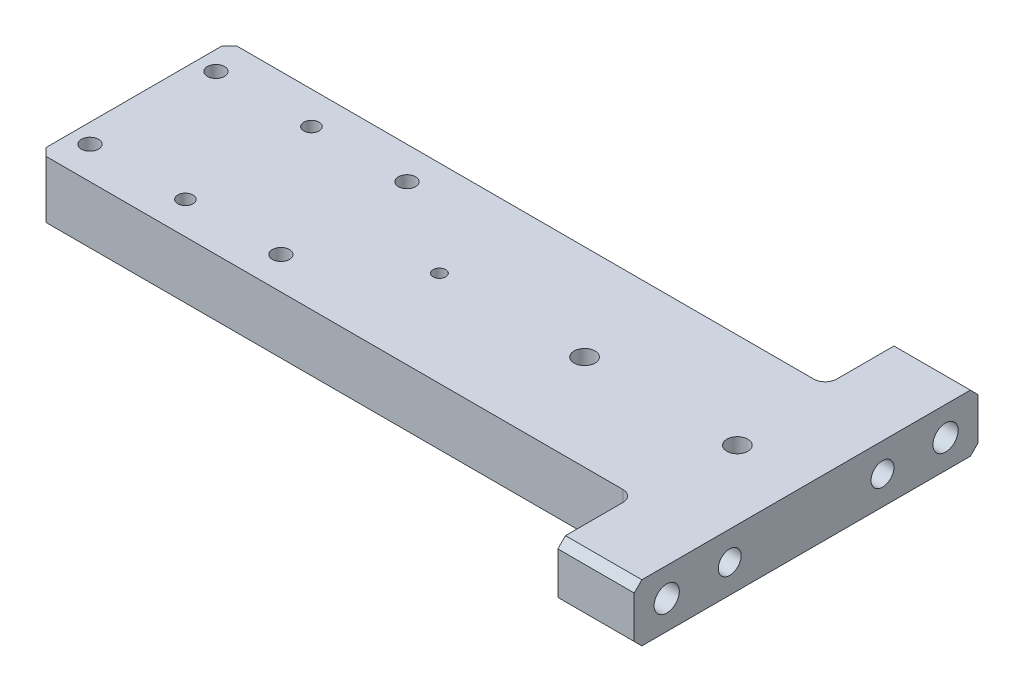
ISO-10303-21;
HEADER;
FILE_DESCRIPTION(('STEP AP214'),'2;1');
FILE_NAME('part.step','',(''),(''),'','','');
FILE_SCHEMA(('AUTOMOTIVE_DESIGN { 1 0 10303 214 1 1 1 1 }'));
ENDSEC;
DATA;
#1=APPLICATION_CONTEXT('core data for automotive mechanical design processes');
#2=APPLICATION_PROTOCOL_DEFINITION('international standard','automotive_design',2000,#1);
#3=PRODUCT_CONTEXT('',#1,'mechanical');
#4=PRODUCT('Part','Part','',(#3));
#5=PRODUCT_RELATED_PRODUCT_CATEGORY('part','',(#4));
#6=PRODUCT_DEFINITION_FORMATION('','',#4);
#7=PRODUCT_DEFINITION_CONTEXT('part definition',#1,'design');
#8=PRODUCT_DEFINITION('design','',#6,#7);
#9=PRODUCT_DEFINITION_SHAPE('','',#8);
#10=(LENGTH_UNIT() NAMED_UNIT(*) SI_UNIT(.MILLI.,.METRE.));
#11=(NAMED_UNIT(*) PLANE_ANGLE_UNIT() SI_UNIT($,.RADIAN.));
#12=(NAMED_UNIT(*) SI_UNIT($,.STERADIAN.) SOLID_ANGLE_UNIT());
#13=UNCERTAINTY_MEASURE_WITH_UNIT(LENGTH_MEASURE(1.E-05),#10,'distance_accuracy_value','');
#14=(GEOMETRIC_REPRESENTATION_CONTEXT(3) GLOBAL_UNCERTAINTY_ASSIGNED_CONTEXT((#13)) GLOBAL_UNIT_ASSIGNED_CONTEXT((#10,
#11,#12)) REPRESENTATION_CONTEXT('',''));
#15=CARTESIAN_POINT('',(0.,0.,0.));
#16=DIRECTION('',(0.,0.,1.));
#17=DIRECTION('',(1.,0.,0.));
#18=AXIS2_PLACEMENT_3D('',#15,#16,#17);
#19=CARTESIAN_POINT('',(88.,15.,-45.));
#20=DIRECTION('',(-1.,0.,0.));
#21=DIRECTION('',(0.,0.,1.));
#22=AXIS2_PLACEMENT_3D('',#19,#20,#21);
#23=PLANE('',#22);
#24=CARTESIAN_POINT('',(88.,7.5,20.));
#25=DIRECTION('',(1.,0.,0.));
#26=DIRECTION('',(0.,0.,-1.));
#27=AXIS2_PLACEMENT_3D('',#24,#25,#26);
#28=CIRCLE('',#27,3.);
#29=CARTESIAN_POINT('',(88.,7.5,17.));
#30=VERTEX_POINT('',#29);
#31=EDGE_CURVE('E191',#30,#30,#28,.T.);
#32=ORIENTED_EDGE('',*,*,#31,.F.);
#33=EDGE_LOOP('',(#32));
#34=FACE_BOUND('',#33,.T.);
#35=CARTESIAN_POINT('',(88.,7.5,-20.));
#36=DIRECTION('',(1.,0.,0.));
#37=DIRECTION('',(0.,0.,-1.));
#38=AXIS2_PLACEMENT_3D('',#35,#36,#37);
#39=CIRCLE('',#38,3.);
#40=CARTESIAN_POINT('',(88.,7.5,-23.));
#41=VERTEX_POINT('',#40);
#42=EDGE_CURVE('E197',#41,#41,#39,.T.);
#43=ORIENTED_EDGE('',*,*,#42,.F.);
#44=EDGE_LOOP('',(#43));
#45=FACE_BOUND('',#44,.T.);
#46=CARTESIAN_POINT('',(88.0000000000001,7.5,36.5));
#47=DIRECTION('',(-1.,0.,0.));
#48=DIRECTION('',(0.,0.,1.));
#49=AXIS2_PLACEMENT_3D('',#46,#47,#48);
#50=CIRCLE('',#49,3.3);
#51=CARTESIAN_POINT('',(88.0000000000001,7.5,39.8));
#52=VERTEX_POINT('',#51);
#53=EDGE_CURVE('E206',#52,#52,#50,.T.);
#54=ORIENTED_EDGE('',*,*,#53,.T.);
#55=EDGE_LOOP('',(#54));
#56=FACE_BOUND('',#55,.T.);
#57=CARTESIAN_POINT('',(88.,7.5,-36.5));
#58=DIRECTION('',(-1.,0.,0.));
#59=DIRECTION('',(0.,0.,1.));
#60=AXIS2_PLACEMENT_3D('',#57,#58,#59);
#61=CIRCLE('',#60,3.3);
#62=CARTESIAN_POINT('',(88.,7.5,-33.2000000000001));
#63=VERTEX_POINT('',#62);
#64=EDGE_CURVE('E212',#63,#63,#61,.T.);
#65=ORIENTED_EDGE('',*,*,#64,.T.);
#66=EDGE_LOOP('',(#65));
#67=FACE_BOUND('',#66,.T.);
#68=DIRECTION('',(0.,0.,-1.));
#69=VECTOR('',#68,1.);
#70=CARTESIAN_POINT('',(88.,0.,-45.));
#71=LINE('',#70,#69);
#72=CARTESIAN_POINT('',(88.,0.,43.));
#73=VERTEX_POINT('',#72);
#74=CARTESIAN_POINT('',(88.,0.,-43.));
#75=VERTEX_POINT('',#74);
#76=EDGE_CURVE('E302',#73,#75,#71,.T.);
#77=ORIENTED_EDGE('',*,*,#76,.T.);
#78=DIRECTION('',(0.,-0.707106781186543,0.707106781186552));
#79=VECTOR('',#78,1.);
#80=CARTESIAN_POINT('',(88.,2.,-45.));
#81=LINE('',#80,#79);
#82=CARTESIAN_POINT('',(88.,1.99999999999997,-45.));
#83=VERTEX_POINT('',#82);
#84=EDGE_CURVE('E389',#75,#83,#81,.F.);
#85=ORIENTED_EDGE('',*,*,#84,.T.);
#86=DIRECTION('',(0.,-1.,0.));
#87=VECTOR('',#86,1.);
#88=CARTESIAN_POINT('',(88.,15.,-45.));
#89=LINE('',#88,#87);
#90=CARTESIAN_POINT('',(88.,13.,-45.));
#91=VERTEX_POINT('',#90);
#92=EDGE_CURVE('E317',#91,#83,#89,.T.);
#93=ORIENTED_EDGE('',*,*,#92,.F.);
#94=DIRECTION('',(0.,0.707106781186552,0.707106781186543));
#95=VECTOR('',#94,1.);
#96=CARTESIAN_POINT('',(88.,15.,-43.));
#97=LINE('',#96,#95);
#98=CARTESIAN_POINT('',(88.,15.,-43.));
#99=VERTEX_POINT('',#98);
#100=EDGE_CURVE('E383',#91,#99,#97,.T.);
#101=ORIENTED_EDGE('',*,*,#100,.T.);
#102=DIRECTION('',(0.,0.,-1.));
#103=VECTOR('',#102,1.);
#104=CARTESIAN_POINT('',(88.,15.,-45.));
#105=LINE('',#104,#103);
#106=CARTESIAN_POINT('',(88.,15.,43.));
#107=VERTEX_POINT('',#106);
#108=EDGE_CURVE('E303',#107,#99,#105,.T.);
#109=ORIENTED_EDGE('',*,*,#108,.F.);
#110=DIRECTION('',(0.,-0.707106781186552,0.707106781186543));
#111=VECTOR('',#110,1.);
#112=CARTESIAN_POINT('',(88.,15.,43.));
#113=LINE('',#112,#111);
#114=CARTESIAN_POINT('',(88.,13.,45.));
#115=VERTEX_POINT('',#114);
#116=EDGE_CURVE('E385',#107,#115,#113,.T.);
#117=ORIENTED_EDGE('',*,*,#116,.T.);
#118=DIRECTION('',(0.,-1.,0.));
#119=VECTOR('',#118,1.);
#120=CARTESIAN_POINT('',(88.,15.,45.));
#121=LINE('',#120,#119);
#122=CARTESIAN_POINT('',(88.,1.99999999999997,45.));
#123=VERTEX_POINT('',#122);
#124=EDGE_CURVE('E310',#115,#123,#121,.T.);
#125=ORIENTED_EDGE('',*,*,#124,.T.);
#126=DIRECTION('',(0.,0.707106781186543,0.707106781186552));
#127=VECTOR('',#126,1.);
#128=CARTESIAN_POINT('',(88.,1.99999999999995,45.));
#129=LINE('',#128,#127);
#130=EDGE_CURVE('E387',#123,#73,#129,.F.);
#131=ORIENTED_EDGE('',*,*,#130,.T.);
#132=EDGE_LOOP('',(#77,#85,#93,#101,#109,#117,#125,#131));
#133=FACE_BOUND('',#132,.T.);
#134=ADVANCED_FACE('F41',(#34,#45,#56,#67,#133),#23,.F.);
#135=CARTESIAN_POINT('',(-88.,15.,-45.));
#136=DIRECTION('',(0.,0.,1.));
#137=DIRECTION('',(1.,0.,0.));
#138=AXIS2_PLACEMENT_3D('',#135,#136,#137);
#139=PLANE('',#138);
#140=ORIENTED_EDGE('',*,*,#92,.T.);
#141=DIRECTION('',(-1.,0.,0.));
#142=VECTOR('',#141,1.);
#143=CARTESIAN_POINT('',(-88.,1.99999999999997,-45.));
#144=LINE('',#143,#142);
#145=CARTESIAN_POINT('',(68.,1.99999999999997,-45.));
#146=VERTEX_POINT('',#145);
#147=EDGE_CURVE('E376',#83,#146,#144,.T.);
#148=ORIENTED_EDGE('',*,*,#147,.T.);
#149=DIRECTION('',(0.,1.,0.));
#150=VECTOR('',#149,1.);
#151=CARTESIAN_POINT('',(68.,15.,-45.));
#152=LINE('',#151,#150);
#153=CARTESIAN_POINT('',(68.,13.,-45.));
#154=VERTEX_POINT('',#153);
#155=EDGE_CURVE('E219',#146,#154,#152,.T.);
#156=ORIENTED_EDGE('',*,*,#155,.T.);
#157=DIRECTION('',(1.,0.,0.));
#158=VECTOR('',#157,1.);
#159=CARTESIAN_POINT('',(88.,13.,-45.));
#160=LINE('',#159,#158);
#161=EDGE_CURVE('E374',#154,#91,#160,.T.);
#162=ORIENTED_EDGE('',*,*,#161,.T.);
#163=EDGE_LOOP('',(#140,#148,#156,#162));
#164=FACE_BOUND('',#163,.T.);
#165=ADVANCED_FACE('F424',(#164),#139,.F.);
#166=CARTESIAN_POINT('',(-88.,15.,-45.));
#167=DIRECTION('',(1.,0.,0.));
#168=DIRECTION('',(0.,0.,-1.));
#169=AXIS2_PLACEMENT_3D('',#166,#167,#168);
#170=PLANE('',#169);
#171=DIRECTION('',(0.,0.,1.));
#172=VECTOR('',#171,1.);
#173=CARTESIAN_POINT('',(-88.,0.,-45.));
#174=LINE('',#173,#172);
#175=CARTESIAN_POINT('',(-88.,0.,-23.));
#176=VERTEX_POINT('',#175);
#177=CARTESIAN_POINT('',(-88.,0.,22.9999999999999));
#178=VERTEX_POINT('',#177);
#179=EDGE_CURVE('E307',#176,#178,#174,.T.);
#180=ORIENTED_EDGE('',*,*,#179,.T.);
#181=DIRECTION('',(0.,1.,0.));
#182=VECTOR('',#181,1.);
#183=CARTESIAN_POINT('',(-88.,15.,23.));
#184=LINE('',#183,#182);
#185=CARTESIAN_POINT('',(-88.,15.,22.9999999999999));
#186=VERTEX_POINT('',#185);
#187=EDGE_CURVE('E349',#178,#186,#184,.T.);
#188=ORIENTED_EDGE('',*,*,#187,.T.);
#189=DIRECTION('',(0.,0.,1.));
#190=VECTOR('',#189,1.);
#191=CARTESIAN_POINT('',(-88.,15.,-45.));
#192=LINE('',#191,#190);
#193=CARTESIAN_POINT('',(-88.,15.,-23.));
#194=VERTEX_POINT('',#193);
#195=EDGE_CURVE('E306',#194,#186,#192,.T.);
#196=ORIENTED_EDGE('',*,*,#195,.F.);
#197=DIRECTION('',(0.,-1.,0.));
#198=VECTOR('',#197,1.);
#199=CARTESIAN_POINT('',(-88.,15.,-23.));
#200=LINE('',#199,#198);
#201=EDGE_CURVE('E346',#194,#176,#200,.T.);
#202=ORIENTED_EDGE('',*,*,#201,.T.);
#203=EDGE_LOOP('',(#180,#188,#196,#202));
#204=FACE_BOUND('',#203,.T.);
#205=ADVANCED_FACE('F447',(#204),#170,.F.);
#206=CARTESIAN_POINT('',(-88.,15.,45.));
#207=DIRECTION('',(0.,0.,-1.));
#208=DIRECTION('',(-1.,0.,0.));
#209=AXIS2_PLACEMENT_3D('',#206,#207,#208);
#210=PLANE('',#209);
#211=DIRECTION('',(0.,-1.,0.));
#212=VECTOR('',#211,1.);
#213=CARTESIAN_POINT('',(68.,15.,45.));
#214=LINE('',#213,#212);
#215=CARTESIAN_POINT('',(68.,13.,45.));
#216=VERTEX_POINT('',#215);
#217=CARTESIAN_POINT('',(68.,1.99999999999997,45.));
#218=VERTEX_POINT('',#217);
#219=EDGE_CURVE('E234',#216,#218,#214,.T.);
#220=ORIENTED_EDGE('',*,*,#219,.T.);
#221=DIRECTION('',(1.,0.,0.));
#222=VECTOR('',#221,1.);
#223=CARTESIAN_POINT('',(-88.,1.99999999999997,45.));
#224=LINE('',#223,#222);
#225=EDGE_CURVE('E392',#218,#123,#224,.T.);
#226=ORIENTED_EDGE('',*,*,#225,.T.);
#227=ORIENTED_EDGE('',*,*,#124,.F.);
#228=DIRECTION('',(-1.,0.,0.));
#229=VECTOR('',#228,1.);
#230=CARTESIAN_POINT('',(68.,13.,45.));
#231=LINE('',#230,#229);
#232=EDGE_CURVE('E62',#115,#216,#231,.T.);
#233=ORIENTED_EDGE('',*,*,#232,.T.);
#234=EDGE_LOOP('',(#220,#226,#227,#233));
#235=FACE_BOUND('',#234,.T.);
#236=ADVANCED_FACE('F407',(#235),#210,.F.);
#237=CARTESIAN_POINT('',(0.,15.,0.));
#238=DIRECTION('',(0.,1.,0.));
#239=DIRECTION('',(0.,0.,1.));
#240=AXIS2_PLACEMENT_3D('',#237,#238,#239);
#241=PLANE('',#240);
#242=CARTESIAN_POINT('',(70.,15.,0.));
#243=DIRECTION('',(0.,-1.,0.));
#244=DIRECTION('',(0.,0.,-1.));
#245=AXIS2_PLACEMENT_3D('',#242,#243,#244);
#246=CIRCLE('',#245,2.75);
#247=CARTESIAN_POINT('',(70.,15.,-2.75));
#248=VERTEX_POINT('',#247);
#249=EDGE_CURVE('E648',#248,#248,#246,.T.);
#250=ORIENTED_EDGE('',*,*,#249,.T.);
#251=EDGE_LOOP('',(#250));
#252=FACE_BOUND('',#251,.T.);
#253=CARTESIAN_POINT('',(30.,15.,0.));
#254=DIRECTION('',(0.,-1.,0.));
#255=DIRECTION('',(0.,0.,-1.));
#256=AXIS2_PLACEMENT_3D('',#253,#254,#255);
#257=CIRCLE('',#256,2.75);
#258=CARTESIAN_POINT('',(30.,15.,-2.75));
#259=VERTEX_POINT('',#258);
#260=EDGE_CURVE('E179',#259,#259,#257,.T.);
#261=ORIENTED_EDGE('',*,*,#260,.T.);
#262=EDGE_LOOP('',(#261));
#263=FACE_BOUND('',#262,.T.);
#264=ORIENTED_EDGE('',*,*,#195,.T.);
#265=DIRECTION('',(-0.707106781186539,0.,-0.707106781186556));
#266=VECTOR('',#265,1.);
#267=CARTESIAN_POINT('',(-55.500000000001,15.,55.4999999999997));
#268=LINE('',#267,#266);
#269=CARTESIAN_POINT('',(-86.,15.,25.));
#270=VERTEX_POINT('',#269);
#271=EDGE_CURVE('E360',#186,#270,#268,.F.);
#272=ORIENTED_EDGE('',*,*,#271,.T.);
#273=DIRECTION('',(-1.,0.,0.));
#274=VECTOR('',#273,1.);
#275=CARTESIAN_POINT('',(-144.979037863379,15.,25.));
#276=LINE('',#275,#274);
#277=CARTESIAN_POINT('',(65.,15.,25.));
#278=VERTEX_POINT('',#277);
#279=EDGE_CURVE('E220',#278,#270,#276,.T.);
#280=ORIENTED_EDGE('',*,*,#279,.F.);
#281=CARTESIAN_POINT('',(65.0000000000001,15.,28.));
#282=DIRECTION('',(0.,1.,0.));
#283=DIRECTION('',(0.,0.,1.));
#284=AXIS2_PLACEMENT_3D('',#281,#282,#283);
#285=CIRCLE('',#284,3.);
#286=CARTESIAN_POINT('',(68.,15.,28.));
#287=VERTEX_POINT('',#286);
#288=EDGE_CURVE('E341',#278,#287,#285,.F.);
#289=ORIENTED_EDGE('',*,*,#288,.T.);
#290=DIRECTION('',(0.,0.,-1.));
#291=VECTOR('',#290,1.);
#292=CARTESIAN_POINT('',(68.0000000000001,15.,65.6184121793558));
#293=LINE('',#292,#291);
#294=CARTESIAN_POINT('',(68.,15.,43.));
#295=VERTEX_POINT('',#294);
#296=EDGE_CURVE('E221',#295,#287,#293,.T.);
#297=ORIENTED_EDGE('',*,*,#296,.F.);
#298=DIRECTION('',(1.,0.,0.));
#299=VECTOR('',#298,1.);
#300=CARTESIAN_POINT('',(88.,15.,43.));
#301=LINE('',#300,#299);
#302=EDGE_CURVE('E355',#295,#107,#301,.T.);
#303=ORIENTED_EDGE('',*,*,#302,.T.);
#304=ORIENTED_EDGE('',*,*,#108,.T.);
#305=DIRECTION('',(-1.,0.,0.));
#306=VECTOR('',#305,1.);
#307=CARTESIAN_POINT('',(68.,15.,-43.));
#308=LINE('',#307,#306);
#309=CARTESIAN_POINT('',(68.,15.,-43.));
#310=VERTEX_POINT('',#309);
#311=EDGE_CURVE('E352',#99,#310,#308,.T.);
#312=ORIENTED_EDGE('',*,*,#311,.T.);
#313=DIRECTION('',(0.,0.,-1.));
#314=VECTOR('',#313,1.);
#315=CARTESIAN_POINT('',(68.,15.,-88.7614918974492));
#316=LINE('',#315,#314);
#317=CARTESIAN_POINT('',(68.,15.,-28.));
#318=VERTEX_POINT('',#317);
#319=EDGE_CURVE('E228',#318,#310,#316,.T.);
#320=ORIENTED_EDGE('',*,*,#319,.F.);
#321=CARTESIAN_POINT('',(65.,15.,-28.));
#322=DIRECTION('',(0.,1.,0.));
#323=DIRECTION('',(0.,0.,1.));
#324=AXIS2_PLACEMENT_3D('',#321,#322,#323);
#325=CIRCLE('',#324,3.);
#326=CARTESIAN_POINT('',(65.,15.,-25.));
#327=VERTEX_POINT('',#326);
#328=EDGE_CURVE('E336',#318,#327,#325,.F.);
#329=ORIENTED_EDGE('',*,*,#328,.T.);
#330=DIRECTION('',(1.,0.,0.));
#331=VECTOR('',#330,1.);
#332=CARTESIAN_POINT('',(-144.979037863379,15.,-25.));
#333=LINE('',#332,#331);
#334=CARTESIAN_POINT('',(-86.,15.,-25.));
#335=VERTEX_POINT('',#334);
#336=EDGE_CURVE('E215',#335,#327,#333,.T.);
#337=ORIENTED_EDGE('',*,*,#336,.F.);
#338=DIRECTION('',(0.707106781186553,0.,-0.707106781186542));
#339=VECTOR('',#338,1.);
#340=CARTESIAN_POINT('',(-55.4999999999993,15.,-55.5000000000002));
#341=LINE('',#340,#339);
#342=EDGE_CURVE('E358',#335,#194,#341,.F.);
#343=ORIENTED_EDGE('',*,*,#342,.T.);
#344=EDGE_LOOP('',(#264,#272,#280,#289,#297,#303,#304,#312,#320,#329,#337,#343));
#345=FACE_BOUND('',#344,.T.);
#346=CARTESIAN_POINT('',(-7.99999999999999,15.,0.));
#347=DIRECTION('',(0.,1.,0.));
#348=DIRECTION('',(0.,0.,1.));
#349=AXIS2_PLACEMENT_3D('',#346,#347,#348);
#350=CIRCLE('',#349,1.65);
#351=CARTESIAN_POINT('',(-7.99999999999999,15.,1.65));
#352=VERTEX_POINT('',#351);
#353=EDGE_CURVE('E236',#352,#352,#350,.T.);
#354=ORIENTED_EDGE('',*,*,#353,.F.);
#355=EDGE_LOOP('',(#354));
#356=FACE_BOUND('',#355,.T.);
#357=CARTESIAN_POINT('',(-58.,15.,16.5));
#358=DIRECTION('',(0.,1.,0.));
#359=DIRECTION('',(0.,0.,1.));
#360=AXIS2_PLACEMENT_3D('',#357,#358,#359);
#361=CIRCLE('',#360,1.99999999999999);
#362=CARTESIAN_POINT('',(-58.,15.,18.5));
#363=VERTEX_POINT('',#362);
#364=EDGE_CURVE('E242',#363,#363,#361,.T.);
#365=ORIENTED_EDGE('',*,*,#364,.F.);
#366=EDGE_LOOP('',(#365));
#367=FACE_BOUND('',#366,.T.);
#368=CARTESIAN_POINT('',(-58.,15.,-16.5));
#369=DIRECTION('',(0.,1.,0.));
#370=DIRECTION('',(0.,0.,1.));
#371=AXIS2_PLACEMENT_3D('',#368,#369,#370);
#372=CIRCLE('',#371,1.99999999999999);
#373=CARTESIAN_POINT('',(-58.,15.,-14.5));
#374=VERTEX_POINT('',#373);
#375=EDGE_CURVE('E248',#374,#374,#372,.T.);
#376=ORIENTED_EDGE('',*,*,#375,.F.);
#377=EDGE_LOOP('',(#376));
#378=FACE_BOUND('',#377,.T.);
#379=CARTESIAN_POINT('',(-83.,15.,-16.5));
#380=DIRECTION('',(0.,-1.,0.));
#381=DIRECTION('',(0.,0.,-1.));
#382=AXIS2_PLACEMENT_3D('',#379,#380,#381);
#383=CIRCLE('',#382,2.25);
#384=CARTESIAN_POINT('',(-83.,15.,-18.75));
#385=VERTEX_POINT('',#384);
#386=EDGE_CURVE('E263',#385,#385,#383,.T.);
#387=ORIENTED_EDGE('',*,*,#386,.T.);
#388=EDGE_LOOP('',(#387));
#389=FACE_BOUND('',#388,.T.);
#390=CARTESIAN_POINT('',(-83.,15.,16.5));
#391=DIRECTION('',(0.,-1.,0.));
#392=DIRECTION('',(0.,0.,-1.));
#393=AXIS2_PLACEMENT_3D('',#390,#391,#392);
#394=CIRCLE('',#393,2.25);
#395=CARTESIAN_POINT('',(-83.,15.,14.25));
#396=VERTEX_POINT('',#395);
#397=EDGE_CURVE('E275',#396,#396,#394,.T.);
#398=ORIENTED_EDGE('',*,*,#397,.T.);
#399=EDGE_LOOP('',(#398));
#400=FACE_BOUND('',#399,.T.);
#401=CARTESIAN_POINT('',(-33.,15.,-16.5));
#402=DIRECTION('',(0.,-1.,0.));
#403=DIRECTION('',(0.,0.,-1.));
#404=AXIS2_PLACEMENT_3D('',#401,#402,#403);
#405=CIRCLE('',#404,2.25);
#406=CARTESIAN_POINT('',(-33.,15.,-18.75));
#407=VERTEX_POINT('',#406);
#408=EDGE_CURVE('E287',#407,#407,#405,.T.);
#409=ORIENTED_EDGE('',*,*,#408,.T.);
#410=EDGE_LOOP('',(#409));
#411=FACE_BOUND('',#410,.T.);
#412=CARTESIAN_POINT('',(-33.,15.,16.5));
#413=DIRECTION('',(0.,-1.,0.));
#414=DIRECTION('',(0.,0.,-1.));
#415=AXIS2_PLACEMENT_3D('',#412,#413,#414);
#416=CIRCLE('',#415,2.25);
#417=CARTESIAN_POINT('',(-33.,15.,14.25));
#418=VERTEX_POINT('',#417);
#419=EDGE_CURVE('E299',#418,#418,#416,.T.);
#420=ORIENTED_EDGE('',*,*,#419,.T.);
#421=EDGE_LOOP('',(#420));
#422=FACE_BOUND('',#421,.T.);
#423=ADVANCED_FACE('F400',(#252,#263,#345,#356,#367,#378,#389,#400,#411,#422),#241,.T.);
#424=CARTESIAN_POINT('',(0.,0.,0.));
#425=DIRECTION('',(0.,1.,0.));
#426=DIRECTION('',(0.,0.,1.));
#427=AXIS2_PLACEMENT_3D('',#424,#425,#426);
#428=PLANE('',#427);
#429=CARTESIAN_POINT('',(70.,0.,0.));
#430=DIRECTION('',(0.,-1.,0.));
#431=DIRECTION('',(0.,0.,-1.));
#432=AXIS2_PLACEMENT_3D('',#429,#430,#431);
#433=CIRCLE('',#432,4.99999999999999);
#434=CARTESIAN_POINT('',(70.,0.,-4.99999999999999));
#435=VERTEX_POINT('',#434);
#436=EDGE_CURVE('E641',#435,#435,#433,.T.);
#437=ORIENTED_EDGE('',*,*,#436,.F.);
#438=EDGE_LOOP('',(#437));
#439=FACE_BOUND('',#438,.T.);
#440=CARTESIAN_POINT('',(30.,0.,0.));
#441=DIRECTION('',(0.,-1.,0.));
#442=DIRECTION('',(0.,0.,-1.));
#443=AXIS2_PLACEMENT_3D('',#440,#441,#442);
#444=CIRCLE('',#443,5.);
#445=CARTESIAN_POINT('',(30.,0.,-5.));
#446=VERTEX_POINT('',#445);
#447=EDGE_CURVE('E651',#446,#446,#444,.T.);
#448=ORIENTED_EDGE('',*,*,#447,.F.);
#449=EDGE_LOOP('',(#448));
#450=FACE_BOUND('',#449,.T.);
#451=CARTESIAN_POINT('',(-30.,0.,-6.00000000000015));
#452=DIRECTION('',(0.,-1.,0.));
#453=DIRECTION('',(0.,0.,-1.));
#454=AXIS2_PLACEMENT_3D('',#451,#452,#453);
#455=CIRCLE('',#454,1.64999999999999);
#456=CARTESIAN_POINT('',(-30.,0.,-7.65000000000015));
#457=VERTEX_POINT('',#456);
#458=EDGE_CURVE('E172',#457,#457,#455,.T.);
#459=ORIENTED_EDGE('',*,*,#458,.F.);
#460=EDGE_LOOP('',(#459));
#461=FACE_BOUND('',#460,.T.);
#462=CARTESIAN_POINT('',(-45.,0.,-6.00000000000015));
#463=DIRECTION('',(0.,-1.,0.));
#464=DIRECTION('',(0.,0.,-1.));
#465=AXIS2_PLACEMENT_3D('',#462,#463,#464);
#466=CIRCLE('',#465,1.64999999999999);
#467=CARTESIAN_POINT('',(-45.,0.,-7.65000000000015));
#468=VERTEX_POINT('',#467);
#469=EDGE_CURVE('E185',#468,#468,#466,.T.);
#470=ORIENTED_EDGE('',*,*,#469,.F.);
#471=EDGE_LOOP('',(#470));
#472=FACE_BOUND('',#471,.T.);
#473=CARTESIAN_POINT('',(-7.99999999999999,0.,0.));
#474=DIRECTION('',(0.,1.,0.));
#475=DIRECTION('',(0.,0.,1.));
#476=AXIS2_PLACEMENT_3D('',#473,#474,#475);
#477=CIRCLE('',#476,1.65);
#478=CARTESIAN_POINT('',(-7.99999999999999,0.,1.65));
#479=VERTEX_POINT('',#478);
#480=EDGE_CURVE('E239',#479,#479,#477,.T.);
#481=ORIENTED_EDGE('',*,*,#480,.T.);
#482=EDGE_LOOP('',(#481));
#483=FACE_BOUND('',#482,.T.);
#484=CARTESIAN_POINT('',(-83.,0.,-16.5));
#485=DIRECTION('',(0.,-1.,0.));
#486=DIRECTION('',(0.,0.,-1.));
#487=AXIS2_PLACEMENT_3D('',#484,#485,#486);
#488=CIRCLE('',#487,4.);
#489=CARTESIAN_POINT('',(-83.,0.,-20.5));
#490=VERTEX_POINT('',#489);
#491=EDGE_CURVE('E254',#490,#490,#488,.T.);
#492=ORIENTED_EDGE('',*,*,#491,.F.);
#493=EDGE_LOOP('',(#492));
#494=FACE_BOUND('',#493,.T.);
#495=CARTESIAN_POINT('',(-83.,0.,16.5));
#496=DIRECTION('',(0.,-1.,0.));
#497=DIRECTION('',(0.,0.,-1.));
#498=AXIS2_PLACEMENT_3D('',#495,#496,#497);
#499=CIRCLE('',#498,4.);
#500=CARTESIAN_POINT('',(-83.,0.,12.5));
#501=VERTEX_POINT('',#500);
#502=EDGE_CURVE('E266',#501,#501,#499,.T.);
#503=ORIENTED_EDGE('',*,*,#502,.F.);
#504=EDGE_LOOP('',(#503));
#505=FACE_BOUND('',#504,.T.);
#506=CARTESIAN_POINT('',(-33.,0.,-16.5));
#507=DIRECTION('',(0.,-1.,0.));
#508=DIRECTION('',(0.,0.,-1.));
#509=AXIS2_PLACEMENT_3D('',#506,#507,#508);
#510=CIRCLE('',#509,4.);
#511=CARTESIAN_POINT('',(-33.,0.,-20.5));
#512=VERTEX_POINT('',#511);
#513=EDGE_CURVE('E278',#512,#512,#510,.T.);
#514=ORIENTED_EDGE('',*,*,#513,.F.);
#515=EDGE_LOOP('',(#514));
#516=FACE_BOUND('',#515,.T.);
#517=CARTESIAN_POINT('',(-33.,0.,16.5));
#518=DIRECTION('',(0.,-1.,0.));
#519=DIRECTION('',(0.,0.,-1.));
#520=AXIS2_PLACEMENT_3D('',#517,#518,#519);
#521=CIRCLE('',#520,4.);
#522=CARTESIAN_POINT('',(-33.,0.,12.5));
#523=VERTEX_POINT('',#522);
#524=EDGE_CURVE('E290',#523,#523,#521,.T.);
#525=ORIENTED_EDGE('',*,*,#524,.F.);
#526=EDGE_LOOP('',(#525));
#527=FACE_BOUND('',#526,.T.);
#528=DIRECTION('',(-1.,0.,0.));
#529=VECTOR('',#528,1.);
#530=CARTESIAN_POINT('',(-144.979037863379,0.,25.));
#531=LINE('',#530,#529);
#532=CARTESIAN_POINT('',(65.,0.,25.));
#533=VERTEX_POINT('',#532);
#534=CARTESIAN_POINT('',(-86.,0.,25.));
#535=VERTEX_POINT('',#534);
#536=EDGE_CURVE('E216',#533,#535,#531,.T.);
#537=ORIENTED_EDGE('',*,*,#536,.T.);
#538=DIRECTION('',(0.707106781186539,0.,0.707106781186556));
#539=VECTOR('',#538,1.);
#540=CARTESIAN_POINT('',(-88.,0.,23.));
#541=LINE('',#540,#539);
#542=EDGE_CURVE('E370',#535,#178,#541,.F.);
#543=ORIENTED_EDGE('',*,*,#542,.T.);
#544=ORIENTED_EDGE('',*,*,#179,.F.);
#545=DIRECTION('',(-0.707106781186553,0.,0.707106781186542));
#546=VECTOR('',#545,1.);
#547=CARTESIAN_POINT('',(-88.,0.,-23.));
#548=LINE('',#547,#546);
#549=CARTESIAN_POINT('',(-86.,0.,-25.));
#550=VERTEX_POINT('',#549);
#551=EDGE_CURVE('E368',#176,#550,#548,.F.);
#552=ORIENTED_EDGE('',*,*,#551,.T.);
#553=DIRECTION('',(1.,0.,0.));
#554=VECTOR('',#553,1.);
#555=CARTESIAN_POINT('',(0.,0.,-25.));
#556=LINE('',#555,#554);
#557=CARTESIAN_POINT('',(65.,0.,-25.));
#558=VERTEX_POINT('',#557);
#559=EDGE_CURVE('E320',#550,#558,#556,.T.);
#560=ORIENTED_EDGE('',*,*,#559,.T.);
#561=CARTESIAN_POINT('',(65.,0.,-28.));
#562=DIRECTION('',(0.,1.,0.));
#563=DIRECTION('',(0.,0.,1.));
#564=AXIS2_PLACEMENT_3D('',#561,#562,#563);
#565=CIRCLE('',#564,3.);
#566=CARTESIAN_POINT('',(68.,0.,-28.));
#567=VERTEX_POINT('',#566);
#568=EDGE_CURVE('E339',#558,#567,#565,.T.);
#569=ORIENTED_EDGE('',*,*,#568,.T.);
#570=DIRECTION('',(0.,0.,-1.));
#571=VECTOR('',#570,1.);
#572=CARTESIAN_POINT('',(68.,0.,-88.7614918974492));
#573=LINE('',#572,#571);
#574=CARTESIAN_POINT('',(68.,0.,-43.));
#575=VERTEX_POINT('',#574);
#576=EDGE_CURVE('E223',#567,#575,#573,.T.);
#577=ORIENTED_EDGE('',*,*,#576,.T.);
#578=DIRECTION('',(1.,0.,0.));
#579=VECTOR('',#578,1.);
#580=CARTESIAN_POINT('',(0.,0.,-43.));
#581=LINE('',#580,#579);
#582=EDGE_CURVE('E366',#575,#75,#581,.T.);
#583=ORIENTED_EDGE('',*,*,#582,.T.);
#584=ORIENTED_EDGE('',*,*,#76,.F.);
#585=DIRECTION('',(-1.,0.,0.));
#586=VECTOR('',#585,1.);
#587=CARTESIAN_POINT('',(0.,0.,43.));
#588=LINE('',#587,#586);
#589=CARTESIAN_POINT('',(68.,0.,43.));
#590=VERTEX_POINT('',#589);
#591=EDGE_CURVE('E364',#73,#590,#588,.T.);
#592=ORIENTED_EDGE('',*,*,#591,.T.);
#593=DIRECTION('',(0.,0.,-1.));
#594=VECTOR('',#593,1.);
#595=CARTESIAN_POINT('',(68.,0.,0.));
#596=LINE('',#595,#594);
#597=CARTESIAN_POINT('',(68.,0.,28.));
#598=VERTEX_POINT('',#597);
#599=EDGE_CURVE('E322',#590,#598,#596,.T.);
#600=ORIENTED_EDGE('',*,*,#599,.T.);
#601=CARTESIAN_POINT('',(65.0000000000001,0.,28.));
#602=DIRECTION('',(0.,1.,0.));
#603=DIRECTION('',(0.,0.,1.));
#604=AXIS2_PLACEMENT_3D('',#601,#602,#603);
#605=CIRCLE('',#604,3.);
#606=EDGE_CURVE('E344',#598,#533,#605,.T.);
#607=ORIENTED_EDGE('',*,*,#606,.T.);
#608=EDGE_LOOP('',(#537,#543,#544,#552,#560,#569,#577,#583,#584,#592,#600,#607));
#609=FACE_BOUND('',#608,.T.);
#610=ADVANCED_FACE('F415',(#439,#450,#461,#472,#483,#494,#505,#516,#527,#609),#428,.F.);
#611=CARTESIAN_POINT('',(-33.,0.,16.5));
#612=DIRECTION('',(0.,-1.,0.));
#613=DIRECTION('',(0.,0.,-1.));
#614=AXIS2_PLACEMENT_3D('',#611,#612,#613);
#615=CYLINDRICAL_SURFACE('',#614,2.25);
#616=ORIENTED_EDGE('',*,*,#419,.F.);
#617=EDGE_LOOP('',(#616));
#618=FACE_BOUND('',#617,.T.);
#619=CARTESIAN_POINT('',(-33.,4.6,16.5));
#620=DIRECTION('',(0.,-1.,0.));
#621=DIRECTION('',(0.,0.,-1.));
#622=AXIS2_PLACEMENT_3D('',#619,#620,#621);
#623=CIRCLE('',#622,2.25);
#624=CARTESIAN_POINT('',(-33.,4.6,14.25));
#625=VERTEX_POINT('',#624);
#626=EDGE_CURVE('E296',#625,#625,#623,.T.);
#627=ORIENTED_EDGE('',*,*,#626,.T.);
#628=EDGE_LOOP('',(#627));
#629=FACE_BOUND('',#628,.T.);
#630=ADVANCED_FACE('F485',(#618,#629),#615,.F.);
#631=CARTESIAN_POINT('',(-30.75,4.6,16.5));
#632=DIRECTION('',(0.,1.,0.));
#633=DIRECTION('',(0.,0.,1.));
#634=AXIS2_PLACEMENT_3D('',#631,#632,#633);
#635=PLANE('',#634);
#636=ORIENTED_EDGE('',*,*,#626,.F.);
#637=EDGE_LOOP('',(#636));
#638=FACE_BOUND('',#637,.T.);
#639=CARTESIAN_POINT('',(-33.,4.6,16.5));
#640=DIRECTION('',(0.,-1.,0.));
#641=DIRECTION('',(0.,0.,-1.));
#642=AXIS2_PLACEMENT_3D('',#639,#640,#641);
#643=CIRCLE('',#642,4.);
#644=CARTESIAN_POINT('',(-33.,4.6,12.5));
#645=VERTEX_POINT('',#644);
#646=EDGE_CURVE('E293',#645,#645,#643,.T.);
#647=ORIENTED_EDGE('',*,*,#646,.T.);
#648=EDGE_LOOP('',(#647));
#649=FACE_BOUND('',#648,.T.);
#650=ADVANCED_FACE('F492',(#638,#649),#635,.F.);
#651=CARTESIAN_POINT('',(-33.,0.,16.5));
#652=DIRECTION('',(0.,-1.,0.));
#653=DIRECTION('',(0.,0.,-1.));
#654=AXIS2_PLACEMENT_3D('',#651,#652,#653);
#655=CYLINDRICAL_SURFACE('',#654,4.);
#656=ORIENTED_EDGE('',*,*,#646,.F.);
#657=EDGE_LOOP('',(#656));
#658=FACE_BOUND('',#657,.T.);
#659=ORIENTED_EDGE('',*,*,#524,.T.);
#660=EDGE_LOOP('',(#659));
#661=FACE_BOUND('',#660,.T.);
#662=ADVANCED_FACE('F496',(#658,#661),#655,.F.);
#663=CARTESIAN_POINT('',(-33.,0.,-16.5));
#664=DIRECTION('',(0.,-1.,0.));
#665=DIRECTION('',(0.,0.,-1.));
#666=AXIS2_PLACEMENT_3D('',#663,#664,#665);
#667=CYLINDRICAL_SURFACE('',#666,2.25);
#668=ORIENTED_EDGE('',*,*,#408,.F.);
#669=EDGE_LOOP('',(#668));
#670=FACE_BOUND('',#669,.T.);
#671=CARTESIAN_POINT('',(-33.,4.6,-16.5));
#672=DIRECTION('',(0.,-1.,0.));
#673=DIRECTION('',(0.,0.,-1.));
#674=AXIS2_PLACEMENT_3D('',#671,#672,#673);
#675=CIRCLE('',#674,2.25);
#676=CARTESIAN_POINT('',(-33.,4.6,-18.75));
#677=VERTEX_POINT('',#676);
#678=EDGE_CURVE('E284',#677,#677,#675,.T.);
#679=ORIENTED_EDGE('',*,*,#678,.T.);
#680=EDGE_LOOP('',(#679));
#681=FACE_BOUND('',#680,.T.);
#682=ADVANCED_FACE('F500',(#670,#681),#667,.F.);
#683=CARTESIAN_POINT('',(-30.75,4.6,-16.5));
#684=DIRECTION('',(0.,1.,0.));
#685=DIRECTION('',(0.,0.,1.));
#686=AXIS2_PLACEMENT_3D('',#683,#684,#685);
#687=PLANE('',#686);
#688=ORIENTED_EDGE('',*,*,#678,.F.);
#689=EDGE_LOOP('',(#688));
#690=FACE_BOUND('',#689,.T.);
#691=CARTESIAN_POINT('',(-33.,4.6,-16.5));
#692=DIRECTION('',(0.,-1.,0.));
#693=DIRECTION('',(0.,0.,-1.));
#694=AXIS2_PLACEMENT_3D('',#691,#692,#693);
#695=CIRCLE('',#694,4.);
#696=CARTESIAN_POINT('',(-33.,4.6,-20.5));
#697=VERTEX_POINT('',#696);
#698=EDGE_CURVE('E281',#697,#697,#695,.T.);
#699=ORIENTED_EDGE('',*,*,#698,.T.);
#700=EDGE_LOOP('',(#699));
#701=FACE_BOUND('',#700,.T.);
#702=ADVANCED_FACE('F504',(#690,#701),#687,.F.);
#703=CARTESIAN_POINT('',(-33.,0.,-16.5));
#704=DIRECTION('',(0.,-1.,0.));
#705=DIRECTION('',(0.,0.,-1.));
#706=AXIS2_PLACEMENT_3D('',#703,#704,#705);
#707=CYLINDRICAL_SURFACE('',#706,4.);
#708=ORIENTED_EDGE('',*,*,#698,.F.);
#709=EDGE_LOOP('',(#708));
#710=FACE_BOUND('',#709,.T.);
#711=ORIENTED_EDGE('',*,*,#513,.T.);
#712=EDGE_LOOP('',(#711));
#713=FACE_BOUND('',#712,.T.);
#714=ADVANCED_FACE('F508',(#710,#713),#707,.F.);
#715=CARTESIAN_POINT('',(-83.,0.,16.5));
#716=DIRECTION('',(0.,-1.,0.));
#717=DIRECTION('',(0.,0.,-1.));
#718=AXIS2_PLACEMENT_3D('',#715,#716,#717);
#719=CYLINDRICAL_SURFACE('',#718,2.25);
#720=ORIENTED_EDGE('',*,*,#397,.F.);
#721=EDGE_LOOP('',(#720));
#722=FACE_BOUND('',#721,.T.);
#723=CARTESIAN_POINT('',(-83.,4.6,16.5));
#724=DIRECTION('',(0.,-1.,0.));
#725=DIRECTION('',(0.,0.,-1.));
#726=AXIS2_PLACEMENT_3D('',#723,#724,#725);
#727=CIRCLE('',#726,2.25);
#728=CARTESIAN_POINT('',(-83.,4.6,14.25));
#729=VERTEX_POINT('',#728);
#730=EDGE_CURVE('E272',#729,#729,#727,.T.);
#731=ORIENTED_EDGE('',*,*,#730,.T.);
#732=EDGE_LOOP('',(#731));
#733=FACE_BOUND('',#732,.T.);
#734=ADVANCED_FACE('F512',(#722,#733),#719,.F.);
#735=CARTESIAN_POINT('',(-80.75,4.6,16.5));
#736=DIRECTION('',(0.,1.,0.));
#737=DIRECTION('',(0.,0.,1.));
#738=AXIS2_PLACEMENT_3D('',#735,#736,#737);
#739=PLANE('',#738);
#740=ORIENTED_EDGE('',*,*,#730,.F.);
#741=EDGE_LOOP('',(#740));
#742=FACE_BOUND('',#741,.T.);
#743=CARTESIAN_POINT('',(-83.,4.6,16.5));
#744=DIRECTION('',(0.,-1.,0.));
#745=DIRECTION('',(0.,0.,-1.));
#746=AXIS2_PLACEMENT_3D('',#743,#744,#745);
#747=CIRCLE('',#746,4.);
#748=CARTESIAN_POINT('',(-83.,4.6,12.5));
#749=VERTEX_POINT('',#748);
#750=EDGE_CURVE('E269',#749,#749,#747,.T.);
#751=ORIENTED_EDGE('',*,*,#750,.T.);
#752=EDGE_LOOP('',(#751));
#753=FACE_BOUND('',#752,.T.);
#754=ADVANCED_FACE('F516',(#742,#753),#739,.F.);
#755=CARTESIAN_POINT('',(-83.,0.,16.5));
#756=DIRECTION('',(0.,-1.,0.));
#757=DIRECTION('',(0.,0.,-1.));
#758=AXIS2_PLACEMENT_3D('',#755,#756,#757);
#759=CYLINDRICAL_SURFACE('',#758,4.);
#760=ORIENTED_EDGE('',*,*,#750,.F.);
#761=EDGE_LOOP('',(#760));
#762=FACE_BOUND('',#761,.T.);
#763=ORIENTED_EDGE('',*,*,#502,.T.);
#764=EDGE_LOOP('',(#763));
#765=FACE_BOUND('',#764,.T.);
#766=ADVANCED_FACE('F520',(#762,#765),#759,.F.);
#767=CARTESIAN_POINT('',(-83.,0.,-16.5));
#768=DIRECTION('',(0.,-1.,0.));
#769=DIRECTION('',(0.,0.,-1.));
#770=AXIS2_PLACEMENT_3D('',#767,#768,#769);
#771=CYLINDRICAL_SURFACE('',#770,2.25);
#772=ORIENTED_EDGE('',*,*,#386,.F.);
#773=EDGE_LOOP('',(#772));
#774=FACE_BOUND('',#773,.T.);
#775=CARTESIAN_POINT('',(-83.,4.6,-16.5));
#776=DIRECTION('',(0.,-1.,0.));
#777=DIRECTION('',(0.,0.,-1.));
#778=AXIS2_PLACEMENT_3D('',#775,#776,#777);
#779=CIRCLE('',#778,2.25);
#780=CARTESIAN_POINT('',(-83.,4.6,-18.75));
#781=VERTEX_POINT('',#780);
#782=EDGE_CURVE('E260',#781,#781,#779,.T.);
#783=ORIENTED_EDGE('',*,*,#782,.T.);
#784=EDGE_LOOP('',(#783));
#785=FACE_BOUND('',#784,.T.);
#786=ADVANCED_FACE('F524',(#774,#785),#771,.F.);
#787=CARTESIAN_POINT('',(-80.75,4.6,-16.5));
#788=DIRECTION('',(0.,1.,0.));
#789=DIRECTION('',(0.,0.,1.));
#790=AXIS2_PLACEMENT_3D('',#787,#788,#789);
#791=PLANE('',#790);
#792=ORIENTED_EDGE('',*,*,#782,.F.);
#793=EDGE_LOOP('',(#792));
#794=FACE_BOUND('',#793,.T.);
#795=CARTESIAN_POINT('',(-83.,4.6,-16.5));
#796=DIRECTION('',(0.,-1.,0.));
#797=DIRECTION('',(0.,0.,-1.));
#798=AXIS2_PLACEMENT_3D('',#795,#796,#797);
#799=CIRCLE('',#798,4.);
#800=CARTESIAN_POINT('',(-83.,4.6,-20.5));
#801=VERTEX_POINT('',#800);
#802=EDGE_CURVE('E257',#801,#801,#799,.T.);
#803=ORIENTED_EDGE('',*,*,#802,.T.);
#804=EDGE_LOOP('',(#803));
#805=FACE_BOUND('',#804,.T.);
#806=ADVANCED_FACE('F528',(#794,#805),#791,.F.);
#807=CARTESIAN_POINT('',(-83.,0.,-16.5));
#808=DIRECTION('',(0.,-1.,0.));
#809=DIRECTION('',(0.,0.,-1.));
#810=AXIS2_PLACEMENT_3D('',#807,#808,#809);
#811=CYLINDRICAL_SURFACE('',#810,4.);
#812=ORIENTED_EDGE('',*,*,#802,.F.);
#813=EDGE_LOOP('',(#812));
#814=FACE_BOUND('',#813,.T.);
#815=ORIENTED_EDGE('',*,*,#491,.T.);
#816=EDGE_LOOP('',(#815));
#817=FACE_BOUND('',#816,.T.);
#818=ADVANCED_FACE('F532',(#814,#817),#811,.F.);
#819=CARTESIAN_POINT('',(-58.,10.,-16.5));
#820=DIRECTION('',(0.,-1.,0.));
#821=DIRECTION('',(0.,0.,-1.));
#822=AXIS2_PLACEMENT_3D('',#819,#820,#821);
#823=PLANE('',#822);
#824=CARTESIAN_POINT('',(-58.,10.,-16.5));
#825=DIRECTION('',(0.,1.,0.));
#826=DIRECTION('',(0.,0.,1.));
#827=AXIS2_PLACEMENT_3D('',#824,#825,#826);
#828=CIRCLE('',#827,1.99999999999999);
#829=CARTESIAN_POINT('',(-58.,10.,-14.5));
#830=VERTEX_POINT('',#829);
#831=EDGE_CURVE('E251',#830,#830,#828,.T.);
#832=ORIENTED_EDGE('',*,*,#831,.T.);
#833=EDGE_LOOP('',(#832));
#834=FACE_BOUND('',#833,.T.);
#835=ADVANCED_FACE('F536',(#834),#823,.F.);
#836=CARTESIAN_POINT('',(-58.,15.,-16.5));
#837=DIRECTION('',(0.,1.,0.));
#838=DIRECTION('',(0.,0.,1.));
#839=AXIS2_PLACEMENT_3D('',#836,#837,#838);
#840=CYLINDRICAL_SURFACE('',#839,1.99999999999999);
#841=ORIENTED_EDGE('',*,*,#831,.F.);
#842=EDGE_LOOP('',(#841));
#843=FACE_BOUND('',#842,.T.);
#844=ORIENTED_EDGE('',*,*,#375,.T.);
#845=EDGE_LOOP('',(#844));
#846=FACE_BOUND('',#845,.T.);
#847=ADVANCED_FACE('F540',(#843,#846),#840,.F.);
#848=CARTESIAN_POINT('',(-58.,10.,16.5));
#849=DIRECTION('',(0.,-1.,0.));
#850=DIRECTION('',(0.,0.,-1.));
#851=AXIS2_PLACEMENT_3D('',#848,#849,#850);
#852=PLANE('',#851);
#853=CARTESIAN_POINT('',(-58.,10.,16.5));
#854=DIRECTION('',(0.,1.,0.));
#855=DIRECTION('',(0.,0.,1.));
#856=AXIS2_PLACEMENT_3D('',#853,#854,#855);
#857=CIRCLE('',#856,1.99999999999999);
#858=CARTESIAN_POINT('',(-58.,10.,18.5));
#859=VERTEX_POINT('',#858);
#860=EDGE_CURVE('E245',#859,#859,#857,.T.);
#861=ORIENTED_EDGE('',*,*,#860,.T.);
#862=EDGE_LOOP('',(#861));
#863=FACE_BOUND('',#862,.T.);
#864=ADVANCED_FACE('F544',(#863),#852,.F.);
#865=CARTESIAN_POINT('',(-58.,15.,16.5));
#866=DIRECTION('',(0.,1.,0.));
#867=DIRECTION('',(0.,0.,1.));
#868=AXIS2_PLACEMENT_3D('',#865,#866,#867);
#869=CYLINDRICAL_SURFACE('',#868,1.99999999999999);
#870=ORIENTED_EDGE('',*,*,#860,.F.);
#871=EDGE_LOOP('',(#870));
#872=FACE_BOUND('',#871,.T.);
#873=ORIENTED_EDGE('',*,*,#364,.T.);
#874=EDGE_LOOP('',(#873));
#875=FACE_BOUND('',#874,.T.);
#876=ADVANCED_FACE('F548',(#872,#875),#869,.F.);
#877=CARTESIAN_POINT('',(-7.99999999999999,15.,0.));
#878=DIRECTION('',(0.,1.,0.));
#879=DIRECTION('',(0.,0.,1.));
#880=AXIS2_PLACEMENT_3D('',#877,#878,#879);
#881=CYLINDRICAL_SURFACE('',#880,1.65);
#882=ORIENTED_EDGE('',*,*,#480,.F.);
#883=EDGE_LOOP('',(#882));
#884=FACE_BOUND('',#883,.T.);
#885=ORIENTED_EDGE('',*,*,#353,.T.);
#886=EDGE_LOOP('',(#885));
#887=FACE_BOUND('',#886,.T.);
#888=ADVANCED_FACE('F552',(#884,#887),#881,.F.);
#889=CARTESIAN_POINT('',(68.,0.,-88.7614918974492));
#890=DIRECTION('',(1.,0.,0.));
#891=DIRECTION('',(0.,0.,-1.));
#892=AXIS2_PLACEMENT_3D('',#889,#890,#891);
#893=PLANE('',#892);
#894=CARTESIAN_POINT('',(68.,7.5,-36.5));
#895=DIRECTION('',(-1.,0.,0.));
#896=DIRECTION('',(0.,0.,1.));
#897=AXIS2_PLACEMENT_3D('',#894,#895,#896);
#898=CIRCLE('',#897,3.29999999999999);
#899=CARTESIAN_POINT('',(68.,7.5,-33.2000000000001));
#900=VERTEX_POINT('',#899);
#901=EDGE_CURVE('E209',#900,#900,#898,.T.);
#902=ORIENTED_EDGE('',*,*,#901,.F.);
#903=EDGE_LOOP('',(#902));
#904=FACE_BOUND('',#903,.T.);
#905=ORIENTED_EDGE('',*,*,#155,.F.);
#906=DIRECTION('',(0.,0.707106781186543,-0.707106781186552));
#907=VECTOR('',#906,1.);
#908=CARTESIAN_POINT('',(68.,2.00000000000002,-45.));
#909=LINE('',#908,#907);
#910=EDGE_CURVE('E381',#146,#575,#909,.F.);
#911=ORIENTED_EDGE('',*,*,#910,.T.);
#912=ORIENTED_EDGE('',*,*,#576,.F.);
#913=DIRECTION('',(0.,1.,0.));
#914=VECTOR('',#913,1.);
#915=CARTESIAN_POINT('',(68.,15.,-28.));
#916=LINE('',#915,#914);
#917=EDGE_CURVE('E324',#567,#318,#916,.T.);
#918=ORIENTED_EDGE('',*,*,#917,.T.);
#919=ORIENTED_EDGE('',*,*,#319,.T.);
#920=DIRECTION('',(0.,-0.707106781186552,-0.707106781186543));
#921=VECTOR('',#920,1.);
#922=CARTESIAN_POINT('',(68.,15.,-43.));
#923=LINE('',#922,#921);
#924=EDGE_CURVE('E379',#310,#154,#923,.T.);
#925=ORIENTED_EDGE('',*,*,#924,.T.);
#926=EDGE_LOOP('',(#905,#911,#912,#918,#919,#925));
#927=FACE_BOUND('',#926,.T.);
#928=ADVANCED_FACE('F431',(#904,#927),#893,.F.);
#929=CARTESIAN_POINT('',(-144.979037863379,0.,-25.));
#930=DIRECTION('',(0.,0.,1.));
#931=DIRECTION('',(1.,0.,0.));
#932=AXIS2_PLACEMENT_3D('',#929,#930,#931);
#933=PLANE('',#932);
#934=CARTESIAN_POINT('',(-13.,7.5,-25.));
#935=DIRECTION('',(0.,0.,-1.));
#936=DIRECTION('',(-1.,0.,0.));
#937=AXIS2_PLACEMENT_3D('',#934,#935,#936);
#938=CIRCLE('',#937,1.64999999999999);
#939=CARTESIAN_POINT('',(-14.65,7.5,-25.));
#940=VERTEX_POINT('',#939);
#941=EDGE_CURVE('E173',#940,#940,#938,.T.);
#942=ORIENTED_EDGE('',*,*,#941,.F.);
#943=EDGE_LOOP('',(#942));
#944=FACE_BOUND('',#943,.T.);
#945=ORIENTED_EDGE('',*,*,#559,.F.);
#946=DIRECTION('',(0.,1.,0.));
#947=VECTOR('',#946,1.);
#948=CARTESIAN_POINT('',(-86.,0.,-25.));
#949=LINE('',#948,#947);
#950=EDGE_CURVE('E372',#550,#335,#949,.T.);
#951=ORIENTED_EDGE('',*,*,#950,.T.);
#952=ORIENTED_EDGE('',*,*,#336,.T.);
#953=DIRECTION('',(0.,1.,0.));
#954=VECTOR('',#953,1.);
#955=CARTESIAN_POINT('',(65.,0.,-25.));
#956=LINE('',#955,#954);
#957=EDGE_CURVE('E327',#327,#558,#956,.F.);
#958=ORIENTED_EDGE('',*,*,#957,.T.);
#959=EDGE_LOOP('',(#945,#951,#952,#958));
#960=FACE_BOUND('',#959,.T.);
#961=ADVANCED_FACE('F557',(#944,#960),#933,.F.);
#962=CARTESIAN_POINT('',(-144.979037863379,0.,25.));
#963=DIRECTION('',(0.,0.,-1.));
#964=DIRECTION('',(-1.,0.,0.));
#965=AXIS2_PLACEMENT_3D('',#962,#963,#964);
#966=PLANE('',#965);
#967=ORIENTED_EDGE('',*,*,#279,.T.);
#968=DIRECTION('',(0.,-1.,0.));
#969=VECTOR('',#968,1.);
#970=CARTESIAN_POINT('',(-86.,0.,25.));
#971=LINE('',#970,#969);
#972=EDGE_CURVE('E362',#270,#535,#971,.T.);
#973=ORIENTED_EDGE('',*,*,#972,.T.);
#974=ORIENTED_EDGE('',*,*,#536,.F.);
#975=DIRECTION('',(0.,1.,0.));
#976=VECTOR('',#975,1.);
#977=CARTESIAN_POINT('',(65.0000000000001,15.,25.));
#978=LINE('',#977,#976);
#979=EDGE_CURVE('E330',#533,#278,#978,.T.);
#980=ORIENTED_EDGE('',*,*,#979,.T.);
#981=EDGE_LOOP('',(#967,#973,#974,#980));
#982=FACE_BOUND('',#981,.T.);
#983=ADVANCED_FACE('F456',(#982),#966,.F.);
#984=CARTESIAN_POINT('',(68.0000000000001,0.,65.6184121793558));
#985=DIRECTION('',(1.,0.,0.));
#986=DIRECTION('',(0.,0.,-1.));
#987=AXIS2_PLACEMENT_3D('',#984,#985,#986);
#988=PLANE('',#987);
#989=CARTESIAN_POINT('',(68.,7.5,36.5));
#990=DIRECTION('',(-1.,0.,0.));
#991=DIRECTION('',(0.,0.,1.));
#992=AXIS2_PLACEMENT_3D('',#989,#990,#991);
#993=CIRCLE('',#992,3.29999999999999);
#994=CARTESIAN_POINT('',(68.,7.5,39.8));
#995=VERTEX_POINT('',#994);
#996=EDGE_CURVE('E203',#995,#995,#993,.T.);
#997=ORIENTED_EDGE('',*,*,#996,.F.);
#998=EDGE_LOOP('',(#997));
#999=FACE_BOUND('',#998,.T.);
#1000=ORIENTED_EDGE('',*,*,#599,.F.);
#1001=DIRECTION('',(0.,-0.707106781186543,-0.707106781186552));
#1002=VECTOR('',#1001,1.);
#1003=CARTESIAN_POINT('',(68.,1.99999999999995,45.));
#1004=LINE('',#1003,#1002);
#1005=EDGE_CURVE('E11',#590,#218,#1004,.F.);
#1006=ORIENTED_EDGE('',*,*,#1005,.T.);
#1007=ORIENTED_EDGE('',*,*,#219,.F.);
#1008=DIRECTION('',(0.,0.707106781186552,-0.707106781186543));
#1009=VECTOR('',#1008,1.);
#1010=CARTESIAN_POINT('',(68.,15.,43.));
#1011=LINE('',#1010,#1009);
#1012=EDGE_CURVE('E50',#216,#295,#1011,.T.);
#1013=ORIENTED_EDGE('',*,*,#1012,.T.);
#1014=ORIENTED_EDGE('',*,*,#296,.T.);
#1015=DIRECTION('',(0.,1.,0.));
#1016=VECTOR('',#1015,1.);
#1017=CARTESIAN_POINT('',(68.,0.,28.));
#1018=LINE('',#1017,#1016);
#1019=EDGE_CURVE('E333',#287,#598,#1018,.F.);
#1020=ORIENTED_EDGE('',*,*,#1019,.T.);
#1021=EDGE_LOOP('',(#1000,#1006,#1007,#1013,#1014,#1020));
#1022=FACE_BOUND('',#1021,.T.);
#1023=ADVANCED_FACE('F396',(#999,#1022),#988,.F.);
#1024=CARTESIAN_POINT('',(68.,7.5,-36.5));
#1025=DIRECTION('',(-1.,0.,0.));
#1026=DIRECTION('',(0.,0.,1.));
#1027=AXIS2_PLACEMENT_3D('',#1024,#1025,#1026);
#1028=CYLINDRICAL_SURFACE('',#1027,3.29999999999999);
#1029=ORIENTED_EDGE('',*,*,#64,.F.);
#1030=EDGE_LOOP('',(#1029));
#1031=FACE_BOUND('',#1030,.T.);
#1032=ORIENTED_EDGE('',*,*,#901,.T.);
#1033=EDGE_LOOP('',(#1032));
#1034=FACE_BOUND('',#1033,.T.);
#1035=ADVANCED_FACE('F566',(#1031,#1034),#1028,.F.);
#1036=CARTESIAN_POINT('',(68.,7.5,36.5));
#1037=DIRECTION('',(-1.,0.,0.));
#1038=DIRECTION('',(0.,0.,1.));
#1039=AXIS2_PLACEMENT_3D('',#1036,#1037,#1038);
#1040=CYLINDRICAL_SURFACE('',#1039,3.29999999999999);
#1041=ORIENTED_EDGE('',*,*,#53,.F.);
#1042=EDGE_LOOP('',(#1041));
#1043=FACE_BOUND('',#1042,.T.);
#1044=ORIENTED_EDGE('',*,*,#996,.T.);
#1045=EDGE_LOOP('',(#1044));
#1046=FACE_BOUND('',#1045,.T.);
#1047=ADVANCED_FACE('F572',(#1043,#1046),#1040,.F.);
#1048=CARTESIAN_POINT('',(83.,7.5,-20.));
#1049=DIRECTION('',(-1.,0.,0.));
#1050=DIRECTION('',(0.,0.,1.));
#1051=AXIS2_PLACEMENT_3D('',#1048,#1049,#1050);
#1052=PLANE('',#1051);
#1053=CARTESIAN_POINT('',(83.,7.5,-20.));
#1054=DIRECTION('',(1.,0.,0.));
#1055=DIRECTION('',(0.,0.,-1.));
#1056=AXIS2_PLACEMENT_3D('',#1053,#1054,#1055);
#1057=CIRCLE('',#1056,3.);
#1058=CARTESIAN_POINT('',(83.,7.5,-23.));
#1059=VERTEX_POINT('',#1058);
#1060=EDGE_CURVE('E200',#1059,#1059,#1057,.T.);
#1061=ORIENTED_EDGE('',*,*,#1060,.T.);
#1062=EDGE_LOOP('',(#1061));
#1063=FACE_BOUND('',#1062,.T.);
#1064=ADVANCED_FACE('F576',(#1063),#1052,.F.);
#1065=CARTESIAN_POINT('',(88.,7.5,-20.));
#1066=DIRECTION('',(1.,0.,0.));
#1067=DIRECTION('',(0.,0.,-1.));
#1068=AXIS2_PLACEMENT_3D('',#1065,#1066,#1067);
#1069=CYLINDRICAL_SURFACE('',#1068,3.);
#1070=ORIENTED_EDGE('',*,*,#1060,.F.);
#1071=EDGE_LOOP('',(#1070));
#1072=FACE_BOUND('',#1071,.T.);
#1073=ORIENTED_EDGE('',*,*,#42,.T.);
#1074=EDGE_LOOP('',(#1073));
#1075=FACE_BOUND('',#1074,.T.);
#1076=ADVANCED_FACE('F580',(#1072,#1075),#1069,.F.);
#1077=CARTESIAN_POINT('',(83.,7.5,20.));
#1078=DIRECTION('',(-1.,0.,0.));
#1079=DIRECTION('',(0.,0.,1.));
#1080=AXIS2_PLACEMENT_3D('',#1077,#1078,#1079);
#1081=PLANE('',#1080);
#1082=CARTESIAN_POINT('',(83.,7.5,20.));
#1083=DIRECTION('',(1.,0.,0.));
#1084=DIRECTION('',(0.,0.,-1.));
#1085=AXIS2_PLACEMENT_3D('',#1082,#1083,#1084);
#1086=CIRCLE('',#1085,3.);
#1087=CARTESIAN_POINT('',(83.,7.5,17.));
#1088=VERTEX_POINT('',#1087);
#1089=EDGE_CURVE('E194',#1088,#1088,#1086,.T.);
#1090=ORIENTED_EDGE('',*,*,#1089,.T.);
#1091=EDGE_LOOP('',(#1090));
#1092=FACE_BOUND('',#1091,.T.);
#1093=ADVANCED_FACE('F584',(#1092),#1081,.F.);
#1094=CARTESIAN_POINT('',(88.,7.5,20.));
#1095=DIRECTION('',(1.,0.,0.));
#1096=DIRECTION('',(0.,0.,-1.));
#1097=AXIS2_PLACEMENT_3D('',#1094,#1095,#1096);
#1098=CYLINDRICAL_SURFACE('',#1097,3.);
#1099=ORIENTED_EDGE('',*,*,#1089,.F.);
#1100=EDGE_LOOP('',(#1099));
#1101=FACE_BOUND('',#1100,.T.);
#1102=ORIENTED_EDGE('',*,*,#31,.T.);
#1103=EDGE_LOOP('',(#1102));
#1104=FACE_BOUND('',#1103,.T.);
#1105=ADVANCED_FACE('F588',(#1101,#1104),#1098,.F.);
#1106=CARTESIAN_POINT('',(-45.,7.99999999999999,-6.00000000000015));
#1107=DIRECTION('',(0.,-1.,0.));
#1108=DIRECTION('',(0.,0.,-1.));
#1109=AXIS2_PLACEMENT_3D('',#1106,#1107,#1108);
#1110=CONICAL_SURFACE('',#1109,1.64999999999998,1.02974425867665);
#1111=CARTESIAN_POINT('',(-45.,8.99142002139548,-6.00000000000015));
#1112=VERTEX_POINT('',#1111);
#1113=VERTEX_LOOP('',#1112);
#1114=FACE_BOUND('',#1113,.T.);
#1115=CARTESIAN_POINT('',(-45.,7.99999999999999,-6.00000000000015));
#1116=DIRECTION('',(0.,-1.,0.));
#1117=DIRECTION('',(0.,0.,-1.));
#1118=AXIS2_PLACEMENT_3D('',#1115,#1116,#1117);
#1119=CIRCLE('',#1118,1.64999999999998);
#1120=CARTESIAN_POINT('',(-45.,7.99999999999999,-7.65000000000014));
#1121=VERTEX_POINT('',#1120);
#1122=EDGE_CURVE('E188',#1121,#1121,#1119,.T.);
#1123=ORIENTED_EDGE('',*,*,#1122,.T.);
#1124=EDGE_LOOP('',(#1123));
#1125=FACE_BOUND('',#1124,.T.);
#1126=ADVANCED_FACE('F592',(#1114,#1125),#1110,.F.);
#1127=CARTESIAN_POINT('',(-45.,0.,-6.00000000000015));
#1128=DIRECTION('',(0.,-1.,0.));
#1129=DIRECTION('',(0.,0.,-1.));
#1130=AXIS2_PLACEMENT_3D('',#1127,#1128,#1129);
#1131=CYLINDRICAL_SURFACE('',#1130,1.64999999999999);
#1132=ORIENTED_EDGE('',*,*,#1122,.F.);
#1133=EDGE_LOOP('',(#1132));
#1134=FACE_BOUND('',#1133,.T.);
#1135=ORIENTED_EDGE('',*,*,#469,.T.);
#1136=EDGE_LOOP('',(#1135));
#1137=FACE_BOUND('',#1136,.T.);
#1138=ADVANCED_FACE('F596',(#1134,#1137),#1131,.F.);
#1139=CARTESIAN_POINT('',(-30.,7.99999999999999,-6.00000000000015));
#1140=DIRECTION('',(0.,-1.,0.));
#1141=DIRECTION('',(0.,0.,-1.));
#1142=AXIS2_PLACEMENT_3D('',#1139,#1140,#1141);
#1143=CONICAL_SURFACE('',#1142,1.64999999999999,1.02974425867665);
#1144=CARTESIAN_POINT('',(-30.,8.99142002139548,-6.00000000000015));
#1145=VERTEX_POINT('',#1144);
#1146=VERTEX_LOOP('',#1145);
#1147=FACE_BOUND('',#1146,.T.);
#1148=CARTESIAN_POINT('',(-30.,7.99999999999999,-6.00000000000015));
#1149=DIRECTION('',(0.,-1.,0.));
#1150=DIRECTION('',(0.,0.,-1.));
#1151=AXIS2_PLACEMENT_3D('',#1148,#1149,#1150);
#1152=CIRCLE('',#1151,1.64999999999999);
#1153=CARTESIAN_POINT('',(-30.,7.99999999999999,-7.65000000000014));
#1154=VERTEX_POINT('',#1153);
#1155=EDGE_CURVE('E176',#1154,#1154,#1152,.T.);
#1156=ORIENTED_EDGE('',*,*,#1155,.T.);
#1157=EDGE_LOOP('',(#1156));
#1158=FACE_BOUND('',#1157,.T.);
#1159=ADVANCED_FACE('F600',(#1147,#1158),#1143,.F.);
#1160=CARTESIAN_POINT('',(-30.,0.,-6.00000000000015));
#1161=DIRECTION('',(0.,-1.,0.));
#1162=DIRECTION('',(0.,0.,-1.));
#1163=AXIS2_PLACEMENT_3D('',#1160,#1161,#1162);
#1164=CYLINDRICAL_SURFACE('',#1163,1.64999999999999);
#1165=ORIENTED_EDGE('',*,*,#1155,.F.);
#1166=EDGE_LOOP('',(#1165));
#1167=FACE_BOUND('',#1166,.T.);
#1168=ORIENTED_EDGE('',*,*,#458,.T.);
#1169=EDGE_LOOP('',(#1168));
#1170=FACE_BOUND('',#1169,.T.);
#1171=ADVANCED_FACE('F166',(#1167,#1170),#1164,.F.);
#1172=CARTESIAN_POINT('',(-13.,7.5,-14.9));
#1173=DIRECTION('',(0.,0.,-1.));
#1174=DIRECTION('',(-1.,0.,0.));
#1175=AXIS2_PLACEMENT_3D('',#1172,#1173,#1174);
#1176=CONICAL_SURFACE('',#1175,1.64999999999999,1.02974425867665);
#1177=CARTESIAN_POINT('',(-13.,7.5,-13.9085799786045));
#1178=VERTEX_POINT('',#1177);
#1179=VERTEX_LOOP('',#1178);
#1180=FACE_BOUND('',#1179,.T.);
#1181=CARTESIAN_POINT('',(-13.,7.5,-14.9));
#1182=DIRECTION('',(0.,0.,-1.));
#1183=DIRECTION('',(-1.,0.,0.));
#1184=AXIS2_PLACEMENT_3D('',#1181,#1182,#1183);
#1185=CIRCLE('',#1184,1.64999999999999);
#1186=CARTESIAN_POINT('',(-14.65,7.5,-14.9));
#1187=VERTEX_POINT('',#1186);
#1188=EDGE_CURVE('E170',#1187,#1187,#1185,.T.);
#1189=ORIENTED_EDGE('',*,*,#1188,.T.);
#1190=EDGE_LOOP('',(#1189));
#1191=FACE_BOUND('',#1190,.T.);
#1192=ADVANCED_FACE('F162',(#1180,#1191),#1176,.F.);
#1193=CARTESIAN_POINT('',(-13.,7.5,-25.));
#1194=DIRECTION('',(0.,0.,-1.));
#1195=DIRECTION('',(-1.,0.,0.));
#1196=AXIS2_PLACEMENT_3D('',#1193,#1194,#1195);
#1197=CYLINDRICAL_SURFACE('',#1196,1.64999999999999);
#1198=ORIENTED_EDGE('',*,*,#1188,.F.);
#1199=EDGE_LOOP('',(#1198));
#1200=FACE_BOUND('',#1199,.T.);
#1201=ORIENTED_EDGE('',*,*,#941,.T.);
#1202=EDGE_LOOP('',(#1201));
#1203=FACE_BOUND('',#1202,.T.);
#1204=ADVANCED_FACE('F165',(#1200,#1203),#1197,.F.);
#1205=CARTESIAN_POINT('',(65.,0.,-28.));
#1206=DIRECTION('',(0.,-1.,0.));
#1207=DIRECTION('',(0.,0.,-1.));
#1208=AXIS2_PLACEMENT_3D('',#1205,#1206,#1207);
#1209=CYLINDRICAL_SURFACE('',#1208,3.);
#1210=ORIENTED_EDGE('',*,*,#568,.F.);
#1211=ORIENTED_EDGE('',*,*,#957,.F.);
#1212=ORIENTED_EDGE('',*,*,#328,.F.);
#1213=ORIENTED_EDGE('',*,*,#917,.F.);
#1214=EDGE_LOOP('',(#1210,#1211,#1212,#1213));
#1215=FACE_BOUND('',#1214,.T.);
#1216=ADVANCED_FACE('F435',(#1215),#1209,.F.);
#1217=CARTESIAN_POINT('',(65.0000000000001,0.,28.));
#1218=DIRECTION('',(0.,-1.,0.));
#1219=DIRECTION('',(0.,0.,-1.));
#1220=AXIS2_PLACEMENT_3D('',#1217,#1218,#1219);
#1221=CYLINDRICAL_SURFACE('',#1220,3.);
#1222=ORIENTED_EDGE('',*,*,#606,.F.);
#1223=ORIENTED_EDGE('',*,*,#1019,.F.);
#1224=ORIENTED_EDGE('',*,*,#288,.F.);
#1225=ORIENTED_EDGE('',*,*,#979,.F.);
#1226=EDGE_LOOP('',(#1222,#1223,#1224,#1225));
#1227=FACE_BOUND('',#1226,.T.);
#1228=ADVANCED_FACE('F460',(#1227),#1221,.F.);
#1229=CARTESIAN_POINT('',(-88.,15.,23.));
#1230=DIRECTION('',(0.707106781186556,0.,-0.707106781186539));
#1231=DIRECTION('',(0.,1.,0.));
#1232=AXIS2_PLACEMENT_3D('',#1229,#1230,#1231);
#1233=PLANE('',#1232);
#1234=ORIENTED_EDGE('',*,*,#542,.F.);
#1235=ORIENTED_EDGE('',*,*,#972,.F.);
#1236=ORIENTED_EDGE('',*,*,#271,.F.);
#1237=ORIENTED_EDGE('',*,*,#187,.F.);
#1238=EDGE_LOOP('',(#1234,#1235,#1236,#1237));
#1239=FACE_BOUND('',#1238,.T.);
#1240=ADVANCED_FACE('F454',(#1239),#1233,.F.);
#1241=CARTESIAN_POINT('',(-88.,15.,-23.));
#1242=DIRECTION('',(0.707106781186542,0.,0.707106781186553));
#1243=DIRECTION('',(0.,-1.,0.));
#1244=AXIS2_PLACEMENT_3D('',#1241,#1242,#1243);
#1245=PLANE('',#1244);
#1246=ORIENTED_EDGE('',*,*,#342,.F.);
#1247=ORIENTED_EDGE('',*,*,#950,.F.);
#1248=ORIENTED_EDGE('',*,*,#551,.F.);
#1249=ORIENTED_EDGE('',*,*,#201,.F.);
#1250=EDGE_LOOP('',(#1246,#1247,#1248,#1249));
#1251=FACE_BOUND('',#1250,.T.);
#1252=ADVANCED_FACE('F444',(#1251),#1245,.F.);
#1253=CARTESIAN_POINT('',(-88.,1.99999999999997,-45.));
#1254=DIRECTION('',(0.,0.707106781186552,0.707106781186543));
#1255=DIRECTION('',(-1.,0.,0.));
#1256=AXIS2_PLACEMENT_3D('',#1253,#1254,#1255);
#1257=PLANE('',#1256);
#1258=ORIENTED_EDGE('',*,*,#84,.F.);
#1259=ORIENTED_EDGE('',*,*,#582,.F.);
#1260=ORIENTED_EDGE('',*,*,#910,.F.);
#1261=ORIENTED_EDGE('',*,*,#147,.F.);
#1262=EDGE_LOOP('',(#1258,#1259,#1260,#1261));
#1263=FACE_BOUND('',#1262,.T.);
#1264=ADVANCED_FACE('F419',(#1263),#1257,.F.);
#1265=CARTESIAN_POINT('',(-88.,1.99999999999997,45.));
#1266=DIRECTION('',(0.,0.707106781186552,-0.707106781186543));
#1267=DIRECTION('',(1.,0.,0.));
#1268=AXIS2_PLACEMENT_3D('',#1265,#1266,#1267);
#1269=PLANE('',#1268);
#1270=ORIENTED_EDGE('',*,*,#1005,.F.);
#1271=ORIENTED_EDGE('',*,*,#591,.F.);
#1272=ORIENTED_EDGE('',*,*,#130,.F.);
#1273=ORIENTED_EDGE('',*,*,#225,.F.);
#1274=EDGE_LOOP('',(#1270,#1271,#1272,#1273));
#1275=FACE_BOUND('',#1274,.T.);
#1276=ADVANCED_FACE('F410',(#1275),#1269,.F.);
#1277=CARTESIAN_POINT('',(0.,15.,43.));
#1278=DIRECTION('',(0.,0.707106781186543,0.707106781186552));
#1279=DIRECTION('',(-1.,0.,0.));
#1280=AXIS2_PLACEMENT_3D('',#1277,#1278,#1279);
#1281=PLANE('',#1280);
#1282=ORIENTED_EDGE('',*,*,#1012,.F.);
#1283=ORIENTED_EDGE('',*,*,#232,.F.);
#1284=ORIENTED_EDGE('',*,*,#116,.F.);
#1285=ORIENTED_EDGE('',*,*,#302,.F.);
#1286=EDGE_LOOP('',(#1282,#1283,#1284,#1285));
#1287=FACE_BOUND('',#1286,.T.);
#1288=ADVANCED_FACE('F405',(#1287),#1281,.T.);
#1289=CARTESIAN_POINT('',(0.,15.,-43.));
#1290=DIRECTION('',(0.,0.707106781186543,-0.707106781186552));
#1291=DIRECTION('',(1.,0.,0.));
#1292=AXIS2_PLACEMENT_3D('',#1289,#1290,#1291);
#1293=PLANE('',#1292);
#1294=ORIENTED_EDGE('',*,*,#100,.F.);
#1295=ORIENTED_EDGE('',*,*,#161,.F.);
#1296=ORIENTED_EDGE('',*,*,#924,.F.);
#1297=ORIENTED_EDGE('',*,*,#311,.F.);
#1298=EDGE_LOOP('',(#1294,#1295,#1296,#1297));
#1299=FACE_BOUND('',#1298,.T.);
#1300=ADVANCED_FACE('F44',(#1299),#1293,.T.);
#1301=CARTESIAN_POINT('',(30.,0.,0.));
#1302=DIRECTION('',(0.,-1.,0.));
#1303=DIRECTION('',(0.,0.,-1.));
#1304=AXIS2_PLACEMENT_3D('',#1301,#1302,#1303);
#1305=CYLINDRICAL_SURFACE('',#1304,2.75);
#1306=ORIENTED_EDGE('',*,*,#260,.F.);
#1307=EDGE_LOOP('',(#1306));
#1308=FACE_BOUND('',#1307,.T.);
#1309=CARTESIAN_POINT('',(30.,5.4,0.));
#1310=DIRECTION('',(0.,-1.,0.));
#1311=DIRECTION('',(0.,0.,-1.));
#1312=AXIS2_PLACEMENT_3D('',#1309,#1310,#1311);
#1313=CIRCLE('',#1312,2.75);
#1314=CARTESIAN_POINT('',(30.,5.4,-2.75));
#1315=VERTEX_POINT('',#1314);
#1316=EDGE_CURVE('E657',#1315,#1315,#1313,.T.);
#1317=ORIENTED_EDGE('',*,*,#1316,.T.);
#1318=EDGE_LOOP('',(#1317));
#1319=FACE_BOUND('',#1318,.T.);
#1320=ADVANCED_FACE('F610',(#1308,#1319),#1305,.F.);
#1321=CARTESIAN_POINT('',(32.75,5.4,0.));
#1322=DIRECTION('',(0.,1.,0.));
#1323=DIRECTION('',(0.,0.,1.));
#1324=AXIS2_PLACEMENT_3D('',#1321,#1322,#1323);
#1325=PLANE('',#1324);
#1326=ORIENTED_EDGE('',*,*,#1316,.F.);
#1327=EDGE_LOOP('',(#1326));
#1328=FACE_BOUND('',#1327,.T.);
#1329=CARTESIAN_POINT('',(30.,5.4,0.));
#1330=DIRECTION('',(0.,-1.,0.));
#1331=DIRECTION('',(0.,0.,-1.));
#1332=AXIS2_PLACEMENT_3D('',#1329,#1330,#1331);
#1333=CIRCLE('',#1332,5.);
#1334=CARTESIAN_POINT('',(30.,5.4,-5.));
#1335=VERTEX_POINT('',#1334);
#1336=EDGE_CURVE('E654',#1335,#1335,#1333,.T.);
#1337=ORIENTED_EDGE('',*,*,#1336,.T.);
#1338=EDGE_LOOP('',(#1337));
#1339=FACE_BOUND('',#1338,.T.);
#1340=ADVANCED_FACE('F613',(#1328,#1339),#1325,.F.);
#1341=CARTESIAN_POINT('',(30.,0.,0.));
#1342=DIRECTION('',(0.,-1.,0.));
#1343=DIRECTION('',(0.,0.,-1.));
#1344=AXIS2_PLACEMENT_3D('',#1341,#1342,#1343);
#1345=CYLINDRICAL_SURFACE('',#1344,5.);
#1346=ORIENTED_EDGE('',*,*,#1336,.F.);
#1347=EDGE_LOOP('',(#1346));
#1348=FACE_BOUND('',#1347,.T.);
#1349=ORIENTED_EDGE('',*,*,#447,.T.);
#1350=EDGE_LOOP('',(#1349));
#1351=FACE_BOUND('',#1350,.T.);
#1352=ADVANCED_FACE('F617',(#1348,#1351),#1345,.F.);
#1353=CARTESIAN_POINT('',(70.,0.,0.));
#1354=DIRECTION('',(0.,-1.,0.));
#1355=DIRECTION('',(0.,0.,-1.));
#1356=AXIS2_PLACEMENT_3D('',#1353,#1354,#1355);
#1357=CYLINDRICAL_SURFACE('',#1356,2.75);
#1358=ORIENTED_EDGE('',*,*,#249,.F.);
#1359=EDGE_LOOP('',(#1358));
#1360=FACE_BOUND('',#1359,.T.);
#1361=CARTESIAN_POINT('',(70.,5.4,0.));
#1362=DIRECTION('',(0.,-1.,0.));
#1363=DIRECTION('',(0.,0.,-1.));
#1364=AXIS2_PLACEMENT_3D('',#1361,#1362,#1363);
#1365=CIRCLE('',#1364,2.75);
#1366=CARTESIAN_POINT('',(70.,5.4,-2.75));
#1367=VERTEX_POINT('',#1366);
#1368=EDGE_CURVE('E643',#1367,#1367,#1365,.T.);
#1369=ORIENTED_EDGE('',*,*,#1368,.T.);
#1370=EDGE_LOOP('',(#1369));
#1371=FACE_BOUND('',#1370,.T.);
#1372=ADVANCED_FACE('F621',(#1360,#1371),#1357,.F.);
#1373=CARTESIAN_POINT('',(72.75,5.4,0.));
#1374=DIRECTION('',(0.,1.,0.));
#1375=DIRECTION('',(0.,0.,1.));
#1376=AXIS2_PLACEMENT_3D('',#1373,#1374,#1375);
#1377=PLANE('',#1376);
#1378=ORIENTED_EDGE('',*,*,#1368,.F.);
#1379=EDGE_LOOP('',(#1378));
#1380=FACE_BOUND('',#1379,.T.);
#1381=CARTESIAN_POINT('',(70.,5.4,0.));
#1382=DIRECTION('',(0.,-1.,0.));
#1383=DIRECTION('',(0.,0.,-1.));
#1384=AXIS2_PLACEMENT_3D('',#1381,#1382,#1383);
#1385=CIRCLE('',#1384,4.99999999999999);
#1386=CARTESIAN_POINT('',(70.,5.4,-4.99999999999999));
#1387=VERTEX_POINT('',#1386);
#1388=EDGE_CURVE('E638',#1387,#1387,#1385,.T.);
#1389=ORIENTED_EDGE('',*,*,#1388,.T.);
#1390=EDGE_LOOP('',(#1389));
#1391=FACE_BOUND('',#1390,.T.);
#1392=ADVANCED_FACE('F625',(#1380,#1391),#1377,.F.);
#1393=CARTESIAN_POINT('',(70.,0.,0.));
#1394=DIRECTION('',(0.,-1.,0.));
#1395=DIRECTION('',(0.,0.,-1.));
#1396=AXIS2_PLACEMENT_3D('',#1393,#1394,#1395);
#1397=CYLINDRICAL_SURFACE('',#1396,4.99999999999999);
#1398=ORIENTED_EDGE('',*,*,#1388,.F.);
#1399=EDGE_LOOP('',(#1398));
#1400=FACE_BOUND('',#1399,.T.);
#1401=ORIENTED_EDGE('',*,*,#436,.T.);
#1402=EDGE_LOOP('',(#1401));
#1403=FACE_BOUND('',#1402,.T.);
#1404=ADVANCED_FACE('F629',(#1400,#1403),#1397,.F.);
#1405=CLOSED_SHELL('',(#134,#165,#205,#236,#423,#610,#630,#650,#662,#682,#702,#714,#734,#754,
#766,#786,#806,#818,#835,#847,#864,#876,#888,#928,#961,#983,#1023,#1035,#1047,#1064,#1076,#1093,
#1105,#1126,#1138,#1159,#1171,#1192,#1204,#1216,#1228,#1240,#1252,#1264,#1276,#1288,#1300,#1320,
#1340,#1352,#1372,#1392,#1404));
#1406=MANIFOLD_SOLID_BREP('B2',#1405);
#1407=ADVANCED_BREP_SHAPE_REPRESENTATION('',(#18,#1406),#14);
#1408=SHAPE_DEFINITION_REPRESENTATION(#9,#1407);
ENDSEC;
END-ISO-10303-21;
